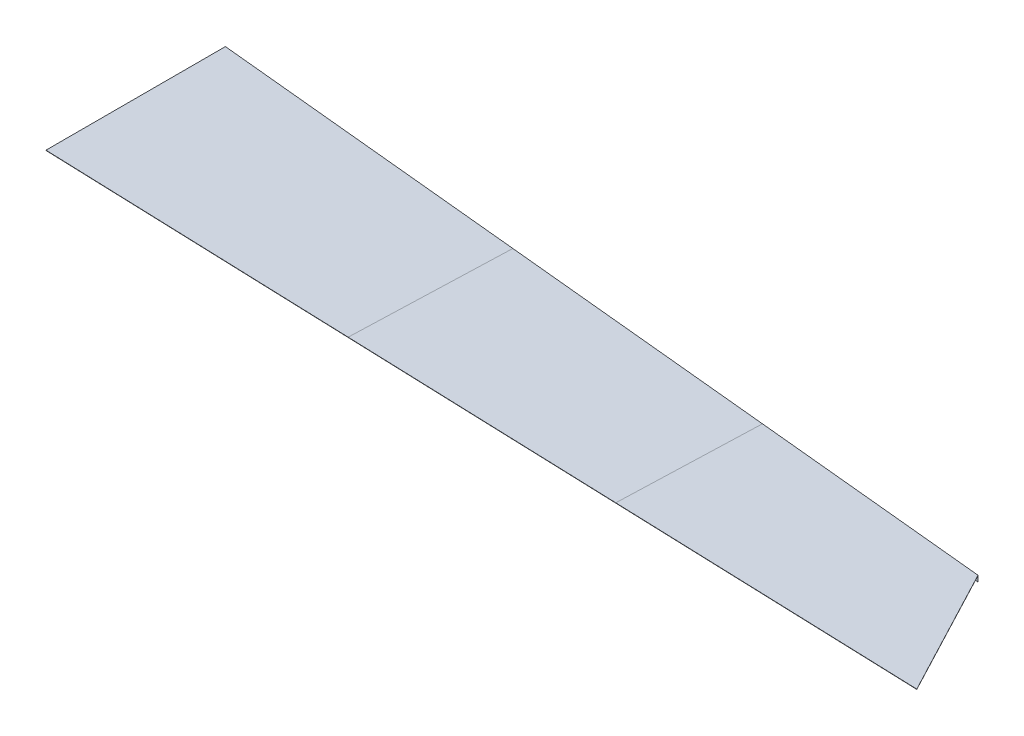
ISO-10303-21;
HEADER;
FILE_DESCRIPTION(('STEP AP214'),'2;1');
FILE_NAME('part.step','',(''),(''),'','','');
FILE_SCHEMA(('AUTOMOTIVE_DESIGN { 1 0 10303 214 1 1 1 1 }'));
ENDSEC;
DATA;
#1=APPLICATION_CONTEXT('core data for automotive mechanical design processes');
#2=APPLICATION_PROTOCOL_DEFINITION('international standard','automotive_design',2000,#1);
#3=PRODUCT_CONTEXT('',#1,'mechanical');
#4=PRODUCT('Part','Part','',(#3));
#5=PRODUCT_RELATED_PRODUCT_CATEGORY('part','',(#4));
#6=PRODUCT_DEFINITION_FORMATION('','',#4);
#7=PRODUCT_DEFINITION_CONTEXT('part definition',#1,'design');
#8=PRODUCT_DEFINITION('design','',#6,#7);
#9=PRODUCT_DEFINITION_SHAPE('','',#8);
#10=(LENGTH_UNIT() NAMED_UNIT(*) SI_UNIT(.MILLI.,.METRE.));
#11=(NAMED_UNIT(*) PLANE_ANGLE_UNIT() SI_UNIT($,.RADIAN.));
#12=(NAMED_UNIT(*) SI_UNIT($,.STERADIAN.) SOLID_ANGLE_UNIT());
#13=UNCERTAINTY_MEASURE_WITH_UNIT(LENGTH_MEASURE(1.E-05),#10,'distance_accuracy_value','');
#14=(GEOMETRIC_REPRESENTATION_CONTEXT(3) GLOBAL_UNCERTAINTY_ASSIGNED_CONTEXT((#13)) GLOBAL_UNIT_ASSIGNED_CONTEXT((#10,
#11,#12)) REPRESENTATION_CONTEXT('',''));
#15=CARTESIAN_POINT('',(0.,0.,0.));
#16=DIRECTION('',(0.,0.,1.));
#17=DIRECTION('',(1.,0.,0.));
#18=AXIS2_PLACEMENT_3D('',#15,#16,#17);
#19=CARTESIAN_POINT('',(-772.827090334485,-140.365470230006,-855.066311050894));
#20=DIRECTION('',(0.999396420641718,0.,0.0347389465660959));
#21=DIRECTION('',(0.0347389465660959,0.,-0.999396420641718));
#22=AXIS2_PLACEMENT_3D('',#19,#20,#21);
#23=PLANE('',#22);
#24=DIRECTION('',(0.,1.,0.));
#25=VECTOR('',#24,1.);
#26=CARTESIAN_POINT('',(-784.630637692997,-1.6256,-515.492888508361));
#27=LINE('',#26,#25);
#28=CARTESIAN_POINT('',(-784.630637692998,-1.6256,-515.492888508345));
#29=VERTEX_POINT('',#28);
#30=CARTESIAN_POINT('',(-784.630637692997,0.,-515.492888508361));
#31=VERTEX_POINT('',#30);
#32=EDGE_CURVE('E200',#29,#31,#27,.T.);
#33=ORIENTED_EDGE('',*,*,#32,.F.);
#34=DIRECTION('',(0.0347389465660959,0.,-0.999396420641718));
#35=VECTOR('',#34,1.);
#36=CARTESIAN_POINT('',(-801.58062102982,-1.6256,-27.8628838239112));
#37=LINE('',#36,#35);
#38=CARTESIAN_POINT('',(-753.442083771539,-1.6256,-1412.7489148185));
#39=VERTEX_POINT('',#38);
#40=EDGE_CURVE('E166',#29,#39,#37,.T.);
#41=ORIENTED_EDGE('',*,*,#40,.T.);
#42=DIRECTION('',(0.,-1.,0.));
#43=VECTOR('',#42,1.);
#44=CARTESIAN_POINT('',(-753.44208377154,0.,-1412.7489148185));
#45=LINE('',#44,#43);
#46=CARTESIAN_POINT('',(-753.442083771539,-31.75,-1412.7489148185));
#47=VERTEX_POINT('',#46);
#48=EDGE_CURVE('E151',#39,#47,#45,.T.);
#49=ORIENTED_EDGE('',*,*,#48,.T.);
#50=DIRECTION('',(0.0347389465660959,0.,-0.999396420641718));
#51=VECTOR('',#50,1.);
#52=CARTESIAN_POINT('',(-925.964378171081,-31.7499999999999,3550.50358841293));
#53=LINE('',#52,#51);
#54=CARTESIAN_POINT('',(-753.385500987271,-31.75,-1414.37673136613));
#55=VERTEX_POINT('',#54);
#56=EDGE_CURVE('E164',#47,#55,#53,.T.);
#57=ORIENTED_EDGE('',*,*,#56,.T.);
#58=DIRECTION('',(0.,-1.,0.));
#59=VECTOR('',#58,1.);
#60=CARTESIAN_POINT('',(-753.385500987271,0.,-1414.37673136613));
#61=LINE('',#60,#59);
#62=CARTESIAN_POINT('',(-753.385500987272,0.,-1414.37673136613));
#63=VERTEX_POINT('',#62);
#64=EDGE_CURVE('E182',#63,#55,#61,.T.);
#65=ORIENTED_EDGE('',*,*,#64,.F.);
#66=DIRECTION('',(0.0347389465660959,0.,-0.999396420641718));
#67=VECTOR('',#66,1.);
#68=CARTESIAN_POINT('',(-801.58062102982,0.,-27.8628838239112));
#69=LINE('',#68,#67);
#70=EDGE_CURVE('E197',#31,#63,#69,.T.);
#71=ORIENTED_EDGE('',*,*,#70,.F.);
#72=EDGE_LOOP('',(#33,#41,#49,#57,#65,#71));
#73=FACE_BOUND('',#72,.T.);
#74=ADVANCED_FACE('F93',(#73),#23,.T.);
#75=CARTESIAN_POINT('',(2571.71966629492,-1.62559999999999,-398.82639715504));
#76=DIRECTION('',(-0.0347389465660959,0.,0.999396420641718));
#77=DIRECTION('',(0.999396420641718,0.,0.0347389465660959));
#78=AXIS2_PLACEMENT_3D('',#75,#76,#77);
#79=PLANE('',#78);
#80=DIRECTION('',(0.999396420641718,0.,0.0347389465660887));
#81=VECTOR('',#80,1.);
#82=CARTESIAN_POINT('',(-2552.7,-1.62560000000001,-576.950850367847));
#83=LINE('',#82,#81);
#84=CARTESIAN_POINT('',(-2552.7,-1.62560000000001,-576.950850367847));
#85=VERTEX_POINT('',#84);
#86=EDGE_CURVE('E174',#85,#29,#83,.T.);
#87=ORIENTED_EDGE('',*,*,#86,.T.);
#88=ORIENTED_EDGE('',*,*,#32,.T.);
#89=DIRECTION('',(0.999396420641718,0.,0.0347389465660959));
#90=VECTOR('',#89,1.);
#91=CARTESIAN_POINT('',(2571.71966629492,0.,-398.82639715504));
#92=LINE('',#91,#90);
#93=CARTESIAN_POINT('',(-2552.7,0.,-576.950850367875));
#94=VERTEX_POINT('',#93);
#95=EDGE_CURVE('E179',#94,#31,#92,.T.);
#96=ORIENTED_EDGE('',*,*,#95,.F.);
#97=DIRECTION('',(0.,1.,0.));
#98=VECTOR('',#97,1.);
#99=CARTESIAN_POINT('',(-2552.7,-1.62559999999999,-576.950850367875));
#100=LINE('',#99,#98);
#101=EDGE_CURVE('E195',#85,#94,#100,.T.);
#102=ORIENTED_EDGE('',*,*,#101,.F.);
#103=EDGE_LOOP('',(#87,#88,#96,#102));
#104=FACE_BOUND('',#103,.T.);
#105=ADVANCED_FACE('F204',(#104),#79,.T.);
#106=CARTESIAN_POINT('',(0.,0.,0.));
#107=DIRECTION('',(0.,1.,0.));
#108=DIRECTION('',(-1.,0.,0.));
#109=AXIS2_PLACEMENT_3D('',#106,#107,#108);
#110=PLANE('',#109);
#111=ORIENTED_EDGE('',*,*,#95,.T.);
#112=ORIENTED_EDGE('',*,*,#70,.T.);
#113=DIRECTION('',(0.995256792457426,0.,0.0972826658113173));
#114=VECTOR('',#113,1.);
#115=CARTESIAN_POINT('',(2189.7343518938,0.,-1126.69766475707));
#116=LINE('',#115,#114);
#117=CARTESIAN_POINT('',(-2552.7,0.,-1590.25306039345));
#118=VERTEX_POINT('',#117);
#119=EDGE_CURVE('E157',#118,#63,#116,.T.);
#120=ORIENTED_EDGE('',*,*,#119,.F.);
#121=DIRECTION('',(0.,0.,-1.));
#122=VECTOR('',#121,1.);
#123=CARTESIAN_POINT('',(-2552.7,0.,1.09982839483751E-12));
#124=LINE('',#123,#122);
#125=EDGE_CURVE('E102',#94,#118,#124,.T.);
#126=ORIENTED_EDGE('',*,*,#125,.F.);
#127=EDGE_LOOP('',(#111,#112,#120,#126));
#128=FACE_BOUND('',#127,.T.);
#129=ADVANCED_FACE('F207',(#128),#110,.T.);
#130=CARTESIAN_POINT('',(0.,-1.6256,0.));
#131=DIRECTION('',(0.,1.,0.));
#132=DIRECTION('',(-1.,0.,0.));
#133=AXIS2_PLACEMENT_3D('',#130,#131,#132);
#134=PLANE('',#133);
#135=ORIENTED_EDGE('',*,*,#40,.F.);
#136=ORIENTED_EDGE('',*,*,#86,.F.);
#137=DIRECTION('',(0.,0.,-1.));
#138=VECTOR('',#137,1.);
#139=CARTESIAN_POINT('',(-2552.7,-1.62560000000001,1.09982839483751E-12));
#140=LINE('',#139,#138);
#141=CARTESIAN_POINT('',(-2552.7,-1.62560000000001,-1588.61971308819));
#142=VERTEX_POINT('',#141);
#143=EDGE_CURVE('E192',#85,#142,#140,.T.);
#144=ORIENTED_EDGE('',*,*,#143,.T.);
#145=DIRECTION('',(-0.995256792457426,0.,-0.0972826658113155));
#146=VECTOR('',#145,1.);
#147=CARTESIAN_POINT('',(-2578.1,-1.62560000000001,-1591.10246902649));
#148=LINE('',#147,#146);
#149=EDGE_CURVE('E177',#39,#142,#148,.T.);
#150=ORIENTED_EDGE('',*,*,#149,.F.);
#151=EDGE_LOOP('',(#135,#136,#144,#150));
#152=FACE_BOUND('',#151,.T.);
#153=ADVANCED_FACE('F211',(#152),#134,.F.);
#154=CARTESIAN_POINT('',(129.811722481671,0.,-1328.04747344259));
#155=DIRECTION('',(0.0972826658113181,0.,-0.995256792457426));
#156=DIRECTION('',(-0.995256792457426,0.,-0.0972826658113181));
#157=AXIS2_PLACEMENT_3D('',#154,#155,#156);
#158=PLANE('',#157);
#159=CARTESIAN_POINT('',(-768.259466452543,-19.05,-1415.83060640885));
#160=DIRECTION('',(0.0972826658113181,0.,-0.995256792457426));
#161=DIRECTION('',(-0.995256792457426,0.,-0.0972826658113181));
#162=AXIS2_PLACEMENT_3D('',#159,#160,#161);
#163=CIRCLE('',#162,1.58749999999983);
#164=CARTESIAN_POINT('',(-769.839436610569,-19.05,-1415.98504264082));
#165=VERTEX_POINT('',#164);
#166=EDGE_CURVE('E262',#165,#165,#163,.T.);
#167=ORIENTED_EDGE('',*,*,#166,.F.);
#168=EDGE_LOOP('',(#167));
#169=FACE_BOUND('',#168,.T.);
#170=CARTESIAN_POINT('',(-1122.1727818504,-19.05,-1450.42432237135));
#171=DIRECTION('',(0.0972826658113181,0.,-0.995256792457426));
#172=DIRECTION('',(-0.995256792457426,0.,-0.0972826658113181));
#173=AXIS2_PLACEMENT_3D('',#170,#171,#172);
#174=CIRCLE('',#173,1.58749999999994);
#175=CARTESIAN_POINT('',(-1123.75275200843,-19.05,-1450.57875860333));
#176=VERTEX_POINT('',#175);
#177=EDGE_CURVE('E284',#176,#176,#174,.T.);
#178=ORIENTED_EDGE('',*,*,#177,.F.);
#179=EDGE_LOOP('',(#178));
#180=FACE_BOUND('',#179,.T.);
#181=CARTESIAN_POINT('',(-1476.08609724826,-19.05,-1485.01803833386));
#182=DIRECTION('',(0.0972826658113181,0.,-0.995256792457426));
#183=DIRECTION('',(-0.995256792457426,0.,-0.0972826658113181));
#184=AXIS2_PLACEMENT_3D('',#181,#182,#183);
#185=CIRCLE('',#184,1.58749999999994);
#186=CARTESIAN_POINT('',(-1477.66606740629,-19.05,-1485.17247456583));
#187=VERTEX_POINT('',#186);
#188=EDGE_CURVE('E287',#187,#187,#185,.T.);
#189=ORIENTED_EDGE('',*,*,#188,.F.);
#190=EDGE_LOOP('',(#189));
#191=FACE_BOUND('',#190,.T.);
#192=CARTESIAN_POINT('',(-1829.99941264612,-19.05,-1519.61175429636));
#193=DIRECTION('',(0.0972826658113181,0.,-0.995256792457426));
#194=DIRECTION('',(-0.995256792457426,0.,-0.0972826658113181));
#195=AXIS2_PLACEMENT_3D('',#192,#193,#194);
#196=CIRCLE('',#195,1.58750000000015);
#197=CARTESIAN_POINT('',(-1831.57938280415,-19.05,-1519.76619052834));
#198=VERTEX_POINT('',#197);
#199=EDGE_CURVE('E292',#198,#198,#196,.T.);
#200=ORIENTED_EDGE('',*,*,#199,.F.);
#201=EDGE_LOOP('',(#200));
#202=FACE_BOUND('',#201,.T.);
#203=CARTESIAN_POINT('',(-2183.91272804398,-19.05,-1554.20547025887));
#204=DIRECTION('',(0.0972826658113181,0.,-0.995256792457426));
#205=DIRECTION('',(-0.995256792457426,0.,-0.0972826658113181));
#206=AXIS2_PLACEMENT_3D('',#203,#204,#205);
#207=CIRCLE('',#206,1.58750000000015);
#208=CARTESIAN_POINT('',(-2185.49269820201,-19.05,-1554.35990649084));
#209=VERTEX_POINT('',#208);
#210=EDGE_CURVE('E295',#209,#209,#207,.T.);
#211=ORIENTED_EDGE('',*,*,#210,.F.);
#212=EDGE_LOOP('',(#211));
#213=FACE_BOUND('',#212,.T.);
#214=CARTESIAN_POINT('',(-2537.82604344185,-19.05,-1588.79918622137));
#215=DIRECTION('',(0.0972826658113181,0.,-0.995256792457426));
#216=DIRECTION('',(-0.995256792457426,0.,-0.0972826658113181));
#217=AXIS2_PLACEMENT_3D('',#214,#215,#216);
#218=CIRCLE('',#217,1.58749999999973);
#219=CARTESIAN_POINT('',(-2539.40601359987,-19.05,-1588.95362245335));
#220=VERTEX_POINT('',#219);
#221=EDGE_CURVE('E298',#220,#220,#218,.T.);
#222=ORIENTED_EDGE('',*,*,#221,.F.);
#223=EDGE_LOOP('',(#222));
#224=FACE_BOUND('',#223,.T.);
#225=ORIENTED_EDGE('',*,*,#119,.T.);
#226=ORIENTED_EDGE('',*,*,#64,.T.);
#227=DIRECTION('',(0.995256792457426,0.,0.0972826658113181));
#228=VECTOR('',#227,1.);
#229=CARTESIAN_POINT('',(2189.7343518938,-31.75,-1126.69766475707));
#230=LINE('',#229,#228);
#231=CARTESIAN_POINT('',(-2552.7,-31.75,-1590.25306039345));
#232=VERTEX_POINT('',#231);
#233=EDGE_CURVE('E158',#232,#55,#230,.T.);
#234=ORIENTED_EDGE('',*,*,#233,.F.);
#235=DIRECTION('',(0.,-1.,0.));
#236=VECTOR('',#235,1.);
#237=CARTESIAN_POINT('',(-2552.7,0.,-1590.25306039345));
#238=LINE('',#237,#236);
#239=EDGE_CURVE('E13',#118,#232,#238,.T.);
#240=ORIENTED_EDGE('',*,*,#239,.F.);
#241=EDGE_LOOP('',(#225,#226,#234,#240));
#242=FACE_BOUND('',#241,.T.);
#243=ADVANCED_FACE('F208',(#169,#180,#191,#202,#213,#224,#242),#158,.T.);
#244=CARTESIAN_POINT('',(-2552.7,0.,1.09982839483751E-12));
#245=DIRECTION('',(1.,0.,0.));
#246=DIRECTION('',(0.,0.,-1.));
#247=AXIS2_PLACEMENT_3D('',#244,#245,#246);
#248=PLANE('',#247);
#249=ORIENTED_EDGE('',*,*,#101,.T.);
#250=ORIENTED_EDGE('',*,*,#125,.T.);
#251=ORIENTED_EDGE('',*,*,#239,.T.);
#252=DIRECTION('',(0.,0.,-1.));
#253=VECTOR('',#252,1.);
#254=CARTESIAN_POINT('',(-2552.7,-31.7499999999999,3642.60062259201));
#255=LINE('',#254,#253);
#256=CARTESIAN_POINT('',(-2552.7,-31.75,-1588.61971308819));
#257=VERTEX_POINT('',#256);
#258=EDGE_CURVE('E176',#257,#232,#255,.T.);
#259=ORIENTED_EDGE('',*,*,#258,.F.);
#260=DIRECTION('',(0.,-1.,0.));
#261=VECTOR('',#260,1.);
#262=CARTESIAN_POINT('',(-2552.7,0.,-1588.61971308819));
#263=LINE('',#262,#261);
#264=EDGE_CURVE('E153',#142,#257,#263,.T.);
#265=ORIENTED_EDGE('',*,*,#264,.F.);
#266=ORIENTED_EDGE('',*,*,#143,.F.);
#267=EDGE_LOOP('',(#249,#250,#251,#259,#265,#266));
#268=FACE_BOUND('',#267,.T.);
#269=ADVANCED_FACE('F210',(#268),#248,.F.);
#270=CARTESIAN_POINT('',(129.653579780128,0.,-1326.42958400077));
#271=DIRECTION('',(0.0972826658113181,0.,-0.995256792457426));
#272=DIRECTION('',(-0.995256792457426,0.,-0.0972826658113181));
#273=AXIS2_PLACEMENT_3D('',#270,#271,#272);
#274=PLANE('',#273);
#275=CARTESIAN_POINT('',(-768.417609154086,-19.05,-1414.21271696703));
#276=DIRECTION('',(0.0972826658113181,0.,-0.995256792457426));
#277=DIRECTION('',(-0.995256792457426,0.,-0.0972826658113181));
#278=AXIS2_PLACEMENT_3D('',#275,#276,#277);
#279=CIRCLE('',#278,1.58749999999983);
#280=CARTESIAN_POINT('',(-769.997579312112,-19.05,-1414.367153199));
#281=VERTEX_POINT('',#280);
#282=EDGE_CURVE('E97',#281,#281,#279,.T.);
#283=ORIENTED_EDGE('',*,*,#282,.T.);
#284=EDGE_LOOP('',(#283));
#285=FACE_BOUND('',#284,.T.);
#286=CARTESIAN_POINT('',(-1122.33092455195,-19.05,-1448.80643292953));
#287=DIRECTION('',(0.0972826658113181,0.,-0.995256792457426));
#288=DIRECTION('',(-0.995256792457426,0.,-0.0972826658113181));
#289=AXIS2_PLACEMENT_3D('',#286,#287,#288);
#290=CIRCLE('',#289,1.58749999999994);
#291=CARTESIAN_POINT('',(-1123.91089470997,-19.05,-1448.96086916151));
#292=VERTEX_POINT('',#291);
#293=EDGE_CURVE('E171',#292,#292,#290,.T.);
#294=ORIENTED_EDGE('',*,*,#293,.T.);
#295=EDGE_LOOP('',(#294));
#296=FACE_BOUND('',#295,.T.);
#297=CARTESIAN_POINT('',(-1476.24423994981,-19.05,-1483.40014889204));
#298=DIRECTION('',(0.0972826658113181,0.,-0.995256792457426));
#299=DIRECTION('',(-0.995256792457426,0.,-0.0972826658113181));
#300=AXIS2_PLACEMENT_3D('',#297,#298,#299);
#301=CIRCLE('',#300,1.58749999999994);
#302=CARTESIAN_POINT('',(-1477.82421010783,-19.05,-1483.55458512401));
#303=VERTEX_POINT('',#302);
#304=EDGE_CURVE('E272',#303,#303,#301,.T.);
#305=ORIENTED_EDGE('',*,*,#304,.T.);
#306=EDGE_LOOP('',(#305));
#307=FACE_BOUND('',#306,.T.);
#308=CARTESIAN_POINT('',(-1830.15755534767,-19.05,-1517.99386485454));
#309=DIRECTION('',(0.0972826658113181,0.,-0.995256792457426));
#310=DIRECTION('',(-0.995256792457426,0.,-0.0972826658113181));
#311=AXIS2_PLACEMENT_3D('',#308,#309,#310);
#312=CIRCLE('',#311,1.58750000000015);
#313=CARTESIAN_POINT('',(-1831.73752550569,-19.05,-1518.14830108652));
#314=VERTEX_POINT('',#313);
#315=EDGE_CURVE('E276',#314,#314,#312,.T.);
#316=ORIENTED_EDGE('',*,*,#315,.T.);
#317=EDGE_LOOP('',(#316));
#318=FACE_BOUND('',#317,.T.);
#319=CARTESIAN_POINT('',(-2184.07087074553,-19.05,-1552.58758081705));
#320=DIRECTION('',(0.0972826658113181,0.,-0.995256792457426));
#321=DIRECTION('',(-0.995256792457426,0.,-0.0972826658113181));
#322=AXIS2_PLACEMENT_3D('',#319,#320,#321);
#323=CIRCLE('',#322,1.58750000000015);
#324=CARTESIAN_POINT('',(-2185.65084090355,-19.05,-1552.74201704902));
#325=VERTEX_POINT('',#324);
#326=EDGE_CURVE('E280',#325,#325,#323,.T.);
#327=ORIENTED_EDGE('',*,*,#326,.T.);
#328=EDGE_LOOP('',(#327));
#329=FACE_BOUND('',#328,.T.);
#330=CARTESIAN_POINT('',(-2537.98418614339,-19.05,-1587.18129677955));
#331=DIRECTION('',(0.0972826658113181,0.,-0.995256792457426));
#332=DIRECTION('',(-0.995256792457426,0.,-0.0972826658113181));
#333=AXIS2_PLACEMENT_3D('',#330,#331,#332);
#334=CIRCLE('',#333,1.58749999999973);
#335=CARTESIAN_POINT('',(-2539.56415630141,-19.05,-1587.33573301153));
#336=VERTEX_POINT('',#335);
#337=EDGE_CURVE('E185',#336,#336,#334,.T.);
#338=ORIENTED_EDGE('',*,*,#337,.T.);
#339=EDGE_LOOP('',(#338));
#340=FACE_BOUND('',#339,.T.);
#341=ORIENTED_EDGE('',*,*,#48,.F.);
#342=ORIENTED_EDGE('',*,*,#149,.T.);
#343=ORIENTED_EDGE('',*,*,#264,.T.);
#344=DIRECTION('',(-0.995256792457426,0.,-0.0972826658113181));
#345=VECTOR('',#344,1.);
#346=CARTESIAN_POINT('',(2189.57620919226,-31.75,-1125.07977531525));
#347=LINE('',#346,#345);
#348=EDGE_CURVE('E148',#47,#257,#347,.T.);
#349=ORIENTED_EDGE('',*,*,#348,.F.);
#350=EDGE_LOOP('',(#341,#342,#343,#349));
#351=FACE_BOUND('',#350,.T.);
#352=ADVANCED_FACE('F150',(#285,#296,#307,#318,#329,#340,#351),#274,.F.);
#353=CARTESIAN_POINT('',(1723.55310604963,-31.7499999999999,3642.600622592));
#354=DIRECTION('',(0.,1.,0.));
#355=DIRECTION('',(0.,0.,1.));
#356=AXIS2_PLACEMENT_3D('',#353,#354,#355);
#357=PLANE('',#356);
#358=ORIENTED_EDGE('',*,*,#56,.F.);
#359=ORIENTED_EDGE('',*,*,#348,.T.);
#360=ORIENTED_EDGE('',*,*,#258,.T.);
#361=ORIENTED_EDGE('',*,*,#233,.T.);
#362=EDGE_LOOP('',(#358,#359,#360,#361));
#363=FACE_BOUND('',#362,.T.);
#364=ADVANCED_FACE('F95',(#363),#357,.F.);
#365=CARTESIAN_POINT('',(-2538.07314141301,-19.05,-1586.27123396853));
#366=DIRECTION('',(0.0972826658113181,0.,-0.995256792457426));
#367=DIRECTION('',(-0.995256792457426,0.,-0.0972826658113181));
#368=AXIS2_PLACEMENT_3D('',#365,#366,#367);
#369=CYLINDRICAL_SURFACE('',#368,1.58749999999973);
#370=ORIENTED_EDGE('',*,*,#221,.T.);
#371=EDGE_LOOP('',(#370));
#372=FACE_BOUND('',#371,.T.);
#373=ORIENTED_EDGE('',*,*,#337,.F.);
#374=EDGE_LOOP('',(#373));
#375=FACE_BOUND('',#374,.T.);
#376=ADVANCED_FACE('F234',(#372,#375),#369,.F.);
#377=CARTESIAN_POINT('',(-2184.15982601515,-19.05,-1551.67751800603));
#378=DIRECTION('',(0.0972826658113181,0.,-0.995256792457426));
#379=DIRECTION('',(-0.995256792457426,0.,-0.0972826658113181));
#380=AXIS2_PLACEMENT_3D('',#377,#378,#379);
#381=CYLINDRICAL_SURFACE('',#380,1.58750000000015);
#382=ORIENTED_EDGE('',*,*,#210,.T.);
#383=EDGE_LOOP('',(#382));
#384=FACE_BOUND('',#383,.T.);
#385=ORIENTED_EDGE('',*,*,#326,.F.);
#386=EDGE_LOOP('',(#385));
#387=FACE_BOUND('',#386,.T.);
#388=ADVANCED_FACE('F238',(#384,#387),#381,.F.);
#389=CARTESIAN_POINT('',(-1830.24651061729,-19.05,-1517.08380204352));
#390=DIRECTION('',(0.0972826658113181,0.,-0.995256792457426));
#391=DIRECTION('',(-0.995256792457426,0.,-0.0972826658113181));
#392=AXIS2_PLACEMENT_3D('',#389,#390,#391);
#393=CYLINDRICAL_SURFACE('',#392,1.58750000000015);
#394=ORIENTED_EDGE('',*,*,#199,.T.);
#395=EDGE_LOOP('',(#394));
#396=FACE_BOUND('',#395,.T.);
#397=ORIENTED_EDGE('',*,*,#315,.F.);
#398=EDGE_LOOP('',(#397));
#399=FACE_BOUND('',#398,.T.);
#400=ADVANCED_FACE('F242',(#396,#399),#393,.F.);
#401=CARTESIAN_POINT('',(-1476.33319521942,-19.05,-1482.49008608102));
#402=DIRECTION('',(0.0972826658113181,0.,-0.995256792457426));
#403=DIRECTION('',(-0.995256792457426,0.,-0.0972826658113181));
#404=AXIS2_PLACEMENT_3D('',#401,#402,#403);
#405=CYLINDRICAL_SURFACE('',#404,1.58749999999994);
#406=ORIENTED_EDGE('',*,*,#188,.T.);
#407=EDGE_LOOP('',(#406));
#408=FACE_BOUND('',#407,.T.);
#409=ORIENTED_EDGE('',*,*,#304,.F.);
#410=EDGE_LOOP('',(#409));
#411=FACE_BOUND('',#410,.T.);
#412=ADVANCED_FACE('F246',(#408,#411),#405,.F.);
#413=CARTESIAN_POINT('',(-1122.41987982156,-19.05,-1447.89637011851));
#414=DIRECTION('',(0.0972826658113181,0.,-0.995256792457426));
#415=DIRECTION('',(-0.995256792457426,0.,-0.0972826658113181));
#416=AXIS2_PLACEMENT_3D('',#413,#414,#415);
#417=CYLINDRICAL_SURFACE('',#416,1.58749999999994);
#418=ORIENTED_EDGE('',*,*,#177,.T.);
#419=EDGE_LOOP('',(#418));
#420=FACE_BOUND('',#419,.T.);
#421=ORIENTED_EDGE('',*,*,#293,.F.);
#422=EDGE_LOOP('',(#421));
#423=FACE_BOUND('',#422,.T.);
#424=ADVANCED_FACE('F250',(#420,#423),#417,.F.);
#425=CARTESIAN_POINT('',(-768.506564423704,-19.05,-1413.30265415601));
#426=DIRECTION('',(0.0972826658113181,0.,-0.995256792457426));
#427=DIRECTION('',(-0.995256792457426,0.,-0.0972826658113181));
#428=AXIS2_PLACEMENT_3D('',#425,#426,#427);
#429=CYLINDRICAL_SURFACE('',#428,1.58749999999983);
#430=ORIENTED_EDGE('',*,*,#166,.T.);
#431=EDGE_LOOP('',(#430));
#432=FACE_BOUND('',#431,.T.);
#433=ORIENTED_EDGE('',*,*,#282,.F.);
#434=EDGE_LOOP('',(#433));
#435=FACE_BOUND('',#434,.T.);
#436=ADVANCED_FACE('F254',(#432,#435),#429,.F.);
#437=CLOSED_SHELL('',(#74,#105,#129,#153,#243,#269,#352,#364,#376,#388,#400,#412,#424,#436));
#438=MANIFOLD_SOLID_BREP('B2',#437);
#439=CARTESIAN_POINT('',(791.646498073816,-124.144312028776,-759.116494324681));
#440=DIRECTION('',(0.999396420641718,0.,0.0347389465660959));
#441=DIRECTION('',(0.0347389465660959,0.,-0.999396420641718));
#442=AXIS2_PLACEMENT_3D('',#439,#440,#441);
#443=PLANE('',#442);
#444=DIRECTION('',(0.,1.,0.));
#445=VECTOR('',#444,1.);
#446=CARTESIAN_POINT('',(781.286136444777,-1.6256,-461.06173584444));
#447=LINE('',#446,#445);
#448=CARTESIAN_POINT('',(781.286136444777,-1.6256,-461.061735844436));
#449=VERTEX_POINT('',#448);
#450=CARTESIAN_POINT('',(781.286136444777,0.,-461.06173584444));
#451=VERTEX_POINT('',#450);
#452=EDGE_CURVE('E476',#449,#451,#447,.T.);
#453=ORIENTED_EDGE('',*,*,#452,.T.);
#454=DIRECTION('',(0.0347389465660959,0.,-0.999396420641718));
#455=VECTOR('',#454,1.);
#456=CARTESIAN_POINT('',(764.336153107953,0.,26.5682688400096));
#457=LINE('',#456,#455);
#458=CARTESIAN_POINT('',(809.114461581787,0.,-1261.64814630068));
#459=VERTEX_POINT('',#458);
#460=EDGE_CURVE('E472',#451,#459,#457,.T.);
#461=ORIENTED_EDGE('',*,*,#460,.T.);
#462=DIRECTION('',(0.,-1.,0.));
#463=VECTOR('',#462,1.);
#464=CARTESIAN_POINT('',(809.114461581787,0.,-1261.64814630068));
#465=LINE('',#464,#463);
#466=CARTESIAN_POINT('',(809.114461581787,-31.75,-1261.64814630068));
#467=VERTEX_POINT('',#466);
#468=EDGE_CURVE('E466',#459,#467,#465,.T.);
#469=ORIENTED_EDGE('',*,*,#468,.T.);
#470=DIRECTION('',(0.0347389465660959,0.,-0.999396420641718));
#471=VECTOR('',#470,1.);
#472=CARTESIAN_POINT('',(639.952395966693,-31.7499999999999,3604.93474107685));
#473=LINE('',#472,#471);
#474=CARTESIAN_POINT('',(809.057878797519,-31.75,-1260.02032975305));
#475=VERTEX_POINT('',#474);
#476=EDGE_CURVE('E494',#475,#467,#473,.T.);
#477=ORIENTED_EDGE('',*,*,#476,.F.);
#478=DIRECTION('',(0.,-1.,0.));
#479=VECTOR('',#478,1.);
#480=CARTESIAN_POINT('',(809.057878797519,0.,-1260.02032975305));
#481=LINE('',#480,#479);
#482=CARTESIAN_POINT('',(809.057878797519,-1.6256,-1260.02032975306));
#483=VERTEX_POINT('',#482);
#484=EDGE_CURVE('E569',#483,#475,#481,.T.);
#485=ORIENTED_EDGE('',*,*,#484,.F.);
#486=DIRECTION('',(0.0347389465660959,0.,-0.999396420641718));
#487=VECTOR('',#486,1.);
#488=CARTESIAN_POINT('',(764.336153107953,-1.6256,26.5682688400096));
#489=LINE('',#488,#487);
#490=EDGE_CURVE('E571',#449,#483,#489,.T.);
#491=ORIENTED_EDGE('',*,*,#490,.F.);
#492=EDGE_LOOP('',(#453,#461,#469,#477,#485,#491));
#493=FACE_BOUND('',#492,.T.);
#494=ADVANCED_FACE('F411',(#493),#443,.F.);
#495=CARTESIAN_POINT('',(2155.9544129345,0.,-1134.43034826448));
#496=DIRECTION('',(-0.884966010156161,0.,0.465655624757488));
#497=DIRECTION('',(0.465655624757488,0.,0.884966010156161));
#498=AXIS2_PLACEMENT_3D('',#495,#496,#497);
#499=PLANE('',#498);
#500=DIRECTION('',(0.,-1.,0.));
#501=VECTOR('',#500,1.);
#502=CARTESIAN_POINT('',(2542.48326093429,-1.62559999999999,-399.842652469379));
#503=LINE('',#502,#501);
#504=CARTESIAN_POINT('',(2542.48326093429,0.,-399.842652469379));
#505=VERTEX_POINT('',#504);
#506=CARTESIAN_POINT('',(2542.48326093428,-1.62559999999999,-399.842652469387));
#507=VERTEX_POINT('',#506);
#508=EDGE_CURVE('E584',#505,#507,#503,.T.);
#509=ORIENTED_EDGE('',*,*,#508,.T.);
#510=DIRECTION('',(0.465655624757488,0.,0.884966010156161));
#511=VECTOR('',#510,1.);
#512=CARTESIAN_POINT('',(2155.9544129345,-1.62559999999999,-1134.43034826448));
#513=LINE('',#512,#511);
#514=CARTESIAN_POINT('',(2159.3182985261,-1.62559999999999,-1128.03737403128));
#515=VERTEX_POINT('',#514);
#516=EDGE_CURVE('E583',#515,#507,#513,.T.);
#517=ORIENTED_EDGE('',*,*,#516,.F.);
#518=DIRECTION('',(0.,1.,0.));
#519=VECTOR('',#518,1.);
#520=CARTESIAN_POINT('',(2159.3182985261,0.,-1128.03737403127));
#521=LINE('',#520,#519);
#522=CARTESIAN_POINT('',(2159.3182985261,-31.75,-1128.03737403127));
#523=VERTEX_POINT('',#522);
#524=EDGE_CURVE('E566',#523,#515,#521,.T.);
#525=ORIENTED_EDGE('',*,*,#524,.F.);
#526=DIRECTION('',(0.465655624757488,0.,0.884966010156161));
#527=VECTOR('',#526,1.);
#528=CARTESIAN_POINT('',(4030.75843422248,-31.75,2428.5843482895));
#529=LINE('',#528,#527);
#530=CARTESIAN_POINT('',(2158.41225593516,-31.75,-1129.75928364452));
#531=VERTEX_POINT('',#530);
#532=EDGE_CURVE('E562',#531,#523,#529,.T.);
#533=ORIENTED_EDGE('',*,*,#532,.F.);
#534=DIRECTION('',(0.,1.,0.));
#535=VECTOR('',#534,1.);
#536=CARTESIAN_POINT('',(2158.41225593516,0.,-1129.75928364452));
#537=LINE('',#536,#535);
#538=CARTESIAN_POINT('',(2158.41225593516,0.,-1129.75928364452));
#539=VERTEX_POINT('',#538);
#540=EDGE_CURVE('E91',#531,#539,#537,.T.);
#541=ORIENTED_EDGE('',*,*,#540,.T.);
#542=DIRECTION('',(0.465655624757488,0.,0.884966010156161));
#543=VECTOR('',#542,1.);
#544=CARTESIAN_POINT('',(2155.9544129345,0.,-1134.43034826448));
#545=LINE('',#544,#543);
#546=EDGE_CURVE('E420',#539,#505,#545,.T.);
#547=ORIENTED_EDGE('',*,*,#546,.T.);
#548=EDGE_LOOP('',(#509,#517,#525,#533,#541,#547));
#549=FACE_BOUND('',#548,.T.);
#550=ADVANCED_FACE('F526',(#549),#499,.F.);
#551=CARTESIAN_POINT('',(2571.71966629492,-1.62559999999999,-398.82639715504));
#552=DIRECTION('',(-0.0347389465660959,0.,0.999396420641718));
#553=DIRECTION('',(0.999396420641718,0.,0.0347389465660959));
#554=AXIS2_PLACEMENT_3D('',#551,#552,#553);
#555=PLANE('',#554);
#556=ORIENTED_EDGE('',*,*,#452,.F.);
#557=DIRECTION('',(0.999396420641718,0.,0.0347389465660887));
#558=VECTOR('',#557,1.);
#559=CARTESIAN_POINT('',(-2552.7,-1.62560000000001,-576.950850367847));
#560=LINE('',#559,#558);
#561=EDGE_CURVE('E579',#449,#507,#560,.T.);
#562=ORIENTED_EDGE('',*,*,#561,.T.);
#563=ORIENTED_EDGE('',*,*,#508,.F.);
#564=DIRECTION('',(0.999396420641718,0.,0.0347389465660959));
#565=VECTOR('',#564,1.);
#566=CARTESIAN_POINT('',(2571.71966629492,0.,-398.82639715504));
#567=LINE('',#566,#565);
#568=EDGE_CURVE('E435',#451,#505,#567,.T.);
#569=ORIENTED_EDGE('',*,*,#568,.F.);
#570=EDGE_LOOP('',(#556,#562,#563,#569));
#571=FACE_BOUND('',#570,.T.);
#572=ADVANCED_FACE('F528',(#571),#555,.T.);
#573=CARTESIAN_POINT('',(0.,-1.6256,0.));
#574=DIRECTION('',(0.,1.,0.));
#575=DIRECTION('',(-1.,0.,0.));
#576=AXIS2_PLACEMENT_3D('',#573,#574,#575);
#577=PLANE('',#576);
#578=ORIENTED_EDGE('',*,*,#561,.F.);
#579=ORIENTED_EDGE('',*,*,#490,.T.);
#580=DIRECTION('',(-0.995256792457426,0.,-0.0972826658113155));
#581=VECTOR('',#580,1.);
#582=CARTESIAN_POINT('',(-2578.1,-1.62560000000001,-1591.10246902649));
#583=LINE('',#582,#581);
#584=EDGE_CURVE('E481',#515,#483,#583,.T.);
#585=ORIENTED_EDGE('',*,*,#584,.F.);
#586=ORIENTED_EDGE('',*,*,#516,.T.);
#587=EDGE_LOOP('',(#578,#579,#585,#586));
#588=FACE_BOUND('',#587,.T.);
#589=ADVANCED_FACE('F537',(#588),#577,.F.);
#590=CARTESIAN_POINT('',(0.,0.,0.));
#591=DIRECTION('',(0.,1.,0.));
#592=DIRECTION('',(-1.,0.,0.));
#593=AXIS2_PLACEMENT_3D('',#590,#591,#592);
#594=PLANE('',#593);
#595=ORIENTED_EDGE('',*,*,#460,.F.);
#596=ORIENTED_EDGE('',*,*,#568,.T.);
#597=ORIENTED_EDGE('',*,*,#546,.F.);
#598=DIRECTION('',(0.995256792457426,0.,0.0972826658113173));
#599=VECTOR('',#598,1.);
#600=CARTESIAN_POINT('',(2189.7343518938,0.,-1126.69766475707));
#601=LINE('',#600,#599);
#602=EDGE_CURVE('E428',#459,#539,#601,.T.);
#603=ORIENTED_EDGE('',*,*,#602,.F.);
#604=EDGE_LOOP('',(#595,#596,#597,#603));
#605=FACE_BOUND('',#604,.T.);
#606=ADVANCED_FACE('F478',(#605),#594,.T.);
#607=CARTESIAN_POINT('',(129.811722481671,0.,-1328.04747344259));
#608=DIRECTION('',(0.0972826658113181,0.,-0.995256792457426));
#609=DIRECTION('',(-0.995256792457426,0.,-0.0972826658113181));
#610=AXIS2_PLACEMENT_3D('',#607,#608,#609);
#611=PLANE('',#610);
#612=CARTESIAN_POINT('',(2141.03258419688,-19.0500000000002,-1131.45808219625));
#613=DIRECTION('',(0.0972826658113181,0.,-0.995256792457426));
#614=DIRECTION('',(-0.995256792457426,0.,-0.0972826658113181));
#615=AXIS2_PLACEMENT_3D('',#612,#613,#614);
#616=CIRCLE('',#615,1.58750000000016);
#617=CARTESIAN_POINT('',(2139.45261403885,-19.0500000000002,-1131.61251842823));
#618=VERTEX_POINT('',#617);
#619=EDGE_CURVE('E499',#618,#618,#616,.T.);
#620=ORIENTED_EDGE('',*,*,#619,.F.);
#621=EDGE_LOOP('',(#620));
#622=FACE_BOUND('',#621,.T.);
#623=CARTESIAN_POINT('',(1812.39879132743,-19.0499999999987,-1163.58081844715));
#624=DIRECTION('',(0.0972826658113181,0.,-0.995256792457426));
#625=DIRECTION('',(-0.995256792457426,0.,-0.0972826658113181));
#626=AXIS2_PLACEMENT_3D('',#623,#624,#625);
#627=CIRCLE('',#626,1.58749999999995);
#628=CARTESIAN_POINT('',(1810.81882116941,-19.0499999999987,-1163.73525467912));
#629=VERTEX_POINT('',#628);
#630=EDGE_CURVE('E612',#629,#629,#627,.T.);
#631=ORIENTED_EDGE('',*,*,#630,.F.);
#632=EDGE_LOOP('',(#631));
#633=FACE_BOUND('',#632,.T.);
#634=CARTESIAN_POINT('',(1483.76499845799,-19.0499999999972,-1195.70355469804));
#635=DIRECTION('',(0.0972826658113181,0.,-0.995256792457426));
#636=DIRECTION('',(-0.995256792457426,0.,-0.0972826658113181));
#637=AXIS2_PLACEMENT_3D('',#634,#635,#636);
#638=CIRCLE('',#637,1.58749999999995);
#639=CARTESIAN_POINT('',(1482.18502829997,-19.0499999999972,-1195.85799093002));
#640=VERTEX_POINT('',#639);
#641=EDGE_CURVE('E603',#640,#640,#638,.T.);
#642=ORIENTED_EDGE('',*,*,#641,.F.);
#643=EDGE_LOOP('',(#642));
#644=FACE_BOUND('',#643,.T.);
#645=CARTESIAN_POINT('',(1155.13120558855,-19.0499999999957,-1227.82629094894));
#646=DIRECTION('',(0.0972826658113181,0.,-0.995256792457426));
#647=DIRECTION('',(-0.995256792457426,0.,-0.0972826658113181));
#648=AXIS2_PLACEMENT_3D('',#645,#646,#647);
#649=CIRCLE('',#648,1.58750000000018);
#650=CARTESIAN_POINT('',(1153.55123543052,-19.0499999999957,-1227.98072718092));
#651=VERTEX_POINT('',#650);
#652=EDGE_CURVE('E613',#651,#651,#649,.T.);
#653=ORIENTED_EDGE('',*,*,#652,.F.);
#654=EDGE_LOOP('',(#653));
#655=FACE_BOUND('',#654,.T.);
#656=CARTESIAN_POINT('',(826.497412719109,-19.0499999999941,-1259.94902719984));
#657=DIRECTION('',(0.0972826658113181,0.,-0.995256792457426));
#658=DIRECTION('',(-0.995256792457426,0.,-0.0972826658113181));
#659=AXIS2_PLACEMENT_3D('',#656,#657,#658);
#660=CIRCLE('',#659,1.58749999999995);
#661=CARTESIAN_POINT('',(824.917442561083,-19.0499999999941,-1260.10346343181));
#662=VERTEX_POINT('',#661);
#663=EDGE_CURVE('E487',#662,#662,#660,.T.);
#664=ORIENTED_EDGE('',*,*,#663,.F.);
#665=EDGE_LOOP('',(#664));
#666=FACE_BOUND('',#665,.T.);
#667=ORIENTED_EDGE('',*,*,#468,.F.);
#668=ORIENTED_EDGE('',*,*,#602,.T.);
#669=ORIENTED_EDGE('',*,*,#540,.F.);
#670=DIRECTION('',(0.995256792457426,0.,0.0972826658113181));
#671=VECTOR('',#670,1.);
#672=CARTESIAN_POINT('',(2189.7343518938,-31.75,-1126.69766475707));
#673=LINE('',#672,#671);
#674=EDGE_CURVE('E469',#467,#531,#673,.T.);
#675=ORIENTED_EDGE('',*,*,#674,.F.);
#676=EDGE_LOOP('',(#667,#668,#669,#675));
#677=FACE_BOUND('',#676,.T.);
#678=ADVANCED_FACE('F468',(#622,#633,#644,#655,#666,#677),#611,.T.);
#679=CARTESIAN_POINT('',(129.653579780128,0.,-1326.42958400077));
#680=DIRECTION('',(0.0972826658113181,0.,-0.995256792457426));
#681=DIRECTION('',(-0.995256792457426,0.,-0.0972826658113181));
#682=AXIS2_PLACEMENT_3D('',#679,#680,#681);
#683=PLANE('',#682);
#684=CARTESIAN_POINT('',(2140.87444149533,-19.0500000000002,-1129.84019275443));
#685=DIRECTION('',(0.0972826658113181,0.,-0.995256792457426));
#686=DIRECTION('',(-0.995256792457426,0.,-0.0972826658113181));
#687=AXIS2_PLACEMENT_3D('',#684,#685,#686);
#688=CIRCLE('',#687,1.58750000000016);
#689=CARTESIAN_POINT('',(2139.29447133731,-19.0500000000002,-1129.99462898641));
#690=VERTEX_POINT('',#689);
#691=EDGE_CURVE('E415',#690,#690,#688,.T.);
#692=ORIENTED_EDGE('',*,*,#691,.T.);
#693=EDGE_LOOP('',(#692));
#694=FACE_BOUND('',#693,.T.);
#695=CARTESIAN_POINT('',(1812.24064862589,-19.0499999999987,-1161.96292900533));
#696=DIRECTION('',(0.0972826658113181,0.,-0.995256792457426));
#697=DIRECTION('',(-0.995256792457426,0.,-0.0972826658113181));
#698=AXIS2_PLACEMENT_3D('',#695,#696,#697);
#699=CIRCLE('',#698,1.58749999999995);
#700=CARTESIAN_POINT('',(1810.66067846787,-19.0499999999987,-1162.1173652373));
#701=VERTEX_POINT('',#700);
#702=EDGE_CURVE('E504',#701,#701,#699,.T.);
#703=ORIENTED_EDGE('',*,*,#702,.T.);
#704=EDGE_LOOP('',(#703));
#705=FACE_BOUND('',#704,.T.);
#706=CARTESIAN_POINT('',(1483.60685575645,-19.0499999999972,-1194.08566525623));
#707=DIRECTION('',(0.0972826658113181,0.,-0.995256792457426));
#708=DIRECTION('',(-0.995256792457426,0.,-0.0972826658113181));
#709=AXIS2_PLACEMENT_3D('',#706,#707,#708);
#710=CIRCLE('',#709,1.58749999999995);
#711=CARTESIAN_POINT('',(1482.02688559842,-19.0499999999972,-1194.2401014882));
#712=VERTEX_POINT('',#711);
#713=EDGE_CURVE('E502',#712,#712,#710,.T.);
#714=ORIENTED_EDGE('',*,*,#713,.T.);
#715=EDGE_LOOP('',(#714));
#716=FACE_BOUND('',#715,.T.);
#717=CARTESIAN_POINT('',(1154.97306288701,-19.0499999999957,-1226.20840150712));
#718=DIRECTION('',(0.0972826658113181,0.,-0.995256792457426));
#719=DIRECTION('',(-0.995256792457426,0.,-0.0972826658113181));
#720=AXIS2_PLACEMENT_3D('',#717,#718,#719);
#721=CIRCLE('',#720,1.58750000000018);
#722=CARTESIAN_POINT('',(1153.39309272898,-19.0499999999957,-1226.3628377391));
#723=VERTEX_POINT('',#722);
#724=EDGE_CURVE('E498',#723,#723,#721,.T.);
#725=ORIENTED_EDGE('',*,*,#724,.T.);
#726=EDGE_LOOP('',(#725));
#727=FACE_BOUND('',#726,.T.);
#728=CARTESIAN_POINT('',(826.339270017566,-19.0499999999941,-1258.33113775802));
#729=DIRECTION('',(0.0972826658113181,0.,-0.995256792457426));
#730=DIRECTION('',(-0.995256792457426,0.,-0.0972826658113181));
#731=AXIS2_PLACEMENT_3D('',#728,#729,#730);
#732=CIRCLE('',#731,1.58749999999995);
#733=CARTESIAN_POINT('',(824.75929985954,-19.0499999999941,-1258.48557399));
#734=VERTEX_POINT('',#733);
#735=EDGE_CURVE('E495',#734,#734,#732,.T.);
#736=ORIENTED_EDGE('',*,*,#735,.T.);
#737=EDGE_LOOP('',(#736));
#738=FACE_BOUND('',#737,.T.);
#739=ORIENTED_EDGE('',*,*,#584,.T.);
#740=ORIENTED_EDGE('',*,*,#484,.T.);
#741=DIRECTION('',(-0.995256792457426,0.,-0.0972826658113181));
#742=VECTOR('',#741,1.);
#743=CARTESIAN_POINT('',(2189.57620919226,-31.75,-1125.07977531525));
#744=LINE('',#743,#742);
#745=EDGE_CURVE('E479',#523,#475,#744,.T.);
#746=ORIENTED_EDGE('',*,*,#745,.F.);
#747=ORIENTED_EDGE('',*,*,#524,.T.);
#748=EDGE_LOOP('',(#739,#740,#746,#747));
#749=FACE_BOUND('',#748,.T.);
#750=ADVANCED_FACE('F511',(#694,#705,#716,#727,#738,#749),#683,.F.);
#751=CARTESIAN_POINT('',(1723.55310604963,-31.7499999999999,3642.600622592));
#752=DIRECTION('',(0.,1.,0.));
#753=DIRECTION('',(0.,0.,1.));
#754=AXIS2_PLACEMENT_3D('',#751,#752,#753);
#755=PLANE('',#754);
#756=ORIENTED_EDGE('',*,*,#745,.T.);
#757=ORIENTED_EDGE('',*,*,#476,.T.);
#758=ORIENTED_EDGE('',*,*,#674,.T.);
#759=ORIENTED_EDGE('',*,*,#532,.T.);
#760=EDGE_LOOP('',(#756,#757,#758,#759));
#761=FACE_BOUND('',#760,.T.);
#762=ADVANCED_FACE('F413',(#761),#755,.F.);
#763=CARTESIAN_POINT('',(826.250314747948,-19.0499999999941,-1257.421074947));
#764=DIRECTION('',(0.0972826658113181,0.,-0.995256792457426));
#765=DIRECTION('',(-0.995256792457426,0.,-0.0972826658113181));
#766=AXIS2_PLACEMENT_3D('',#763,#764,#765);
#767=CYLINDRICAL_SURFACE('',#766,1.58749999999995);
#768=ORIENTED_EDGE('',*,*,#663,.T.);
#769=EDGE_LOOP('',(#768));
#770=FACE_BOUND('',#769,.T.);
#771=ORIENTED_EDGE('',*,*,#735,.F.);
#772=EDGE_LOOP('',(#771));
#773=FACE_BOUND('',#772,.T.);
#774=ADVANCED_FACE('F534',(#770,#773),#767,.F.);
#775=CARTESIAN_POINT('',(1154.88410761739,-19.0499999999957,-1225.2983386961));
#776=DIRECTION('',(0.0972826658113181,0.,-0.995256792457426));
#777=DIRECTION('',(-0.995256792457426,0.,-0.0972826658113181));
#778=AXIS2_PLACEMENT_3D('',#775,#776,#777);
#779=CYLINDRICAL_SURFACE('',#778,1.58750000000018);
#780=ORIENTED_EDGE('',*,*,#652,.T.);
#781=EDGE_LOOP('',(#780));
#782=FACE_BOUND('',#781,.T.);
#783=ORIENTED_EDGE('',*,*,#724,.F.);
#784=EDGE_LOOP('',(#783));
#785=FACE_BOUND('',#784,.T.);
#786=ADVANCED_FACE('F557',(#782,#785),#779,.F.);
#787=CARTESIAN_POINT('',(1483.51790048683,-19.0499999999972,-1193.1756024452));
#788=DIRECTION('',(0.0972826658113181,0.,-0.995256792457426));
#789=DIRECTION('',(-0.995256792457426,0.,-0.0972826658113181));
#790=AXIS2_PLACEMENT_3D('',#787,#788,#789);
#791=CYLINDRICAL_SURFACE('',#790,1.58749999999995);
#792=ORIENTED_EDGE('',*,*,#641,.T.);
#793=EDGE_LOOP('',(#792));
#794=FACE_BOUND('',#793,.T.);
#795=ORIENTED_EDGE('',*,*,#713,.F.);
#796=EDGE_LOOP('',(#795));
#797=FACE_BOUND('',#796,.T.);
#798=ADVANCED_FACE('F521',(#794,#797),#791,.F.);
#799=CARTESIAN_POINT('',(1812.15169335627,-19.0499999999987,-1161.05286619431));
#800=DIRECTION('',(0.0972826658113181,0.,-0.995256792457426));
#801=DIRECTION('',(-0.995256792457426,0.,-0.0972826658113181));
#802=AXIS2_PLACEMENT_3D('',#799,#800,#801);
#803=CYLINDRICAL_SURFACE('',#802,1.58749999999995);
#804=ORIENTED_EDGE('',*,*,#630,.T.);
#805=EDGE_LOOP('',(#804));
#806=FACE_BOUND('',#805,.T.);
#807=ORIENTED_EDGE('',*,*,#702,.F.);
#808=EDGE_LOOP('',(#807));
#809=FACE_BOUND('',#808,.T.);
#810=ADVANCED_FACE('F515',(#806,#809),#803,.F.);
#811=CARTESIAN_POINT('',(2140.78548622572,-19.0500000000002,-1128.93012994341));
#812=DIRECTION('',(0.0972826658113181,0.,-0.995256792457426));
#813=DIRECTION('',(-0.995256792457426,0.,-0.0972826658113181));
#814=AXIS2_PLACEMENT_3D('',#811,#812,#813);
#815=CYLINDRICAL_SURFACE('',#814,1.58750000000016);
#816=ORIENTED_EDGE('',*,*,#619,.T.);
#817=EDGE_LOOP('',(#816));
#818=FACE_BOUND('',#817,.T.);
#819=ORIENTED_EDGE('',*,*,#691,.F.);
#820=EDGE_LOOP('',(#819));
#821=FACE_BOUND('',#820,.T.);
#822=ADVANCED_FACE('F513',(#818,#821),#815,.F.);
#823=CLOSED_SHELL('',(#494,#550,#572,#589,#606,#678,#750,#762,#774,#786,#798,#810,#822));
#824=MANIFOLD_SOLID_BREP('B7',#823);
#825=CARTESIAN_POINT('',(-772.827090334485,-140.365470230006,-855.066311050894));
#826=DIRECTION('',(0.999396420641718,0.,0.0347389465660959));
#827=DIRECTION('',(0.0347389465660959,0.,-0.999396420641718));
#828=AXIS2_PLACEMENT_3D('',#825,#826,#827);
#829=PLANE('',#828);
#830=DIRECTION('',(0.,1.,0.));
#831=VECTOR('',#830,1.);
#832=CARTESIAN_POINT('',(-784.630637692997,-1.6256,-515.492888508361));
#833=LINE('',#832,#831);
#834=CARTESIAN_POINT('',(-784.630637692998,-1.6256,-515.492888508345));
#835=VERTEX_POINT('',#834);
#836=CARTESIAN_POINT('',(-784.630637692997,0.,-515.492888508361));
#837=VERTEX_POINT('',#836);
#838=EDGE_CURVE('E788',#835,#837,#833,.T.);
#839=ORIENTED_EDGE('',*,*,#838,.T.);
#840=DIRECTION('',(0.0347389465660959,0.,-0.999396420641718));
#841=VECTOR('',#840,1.);
#842=CARTESIAN_POINT('',(-801.58062102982,0.,-27.8628838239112));
#843=LINE('',#842,#841);
#844=CARTESIAN_POINT('',(-753.385500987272,0.,-1414.37673136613));
#845=VERTEX_POINT('',#844);
#846=EDGE_CURVE('E781',#837,#845,#843,.T.);
#847=ORIENTED_EDGE('',*,*,#846,.T.);
#848=DIRECTION('',(0.,-1.,0.));
#849=VECTOR('',#848,1.);
#850=CARTESIAN_POINT('',(-753.385500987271,0.,-1414.37673136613));
#851=LINE('',#850,#849);
#852=CARTESIAN_POINT('',(-753.385500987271,-31.75,-1414.37673136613));
#853=VERTEX_POINT('',#852);
#854=EDGE_CURVE('E765',#845,#853,#851,.T.);
#855=ORIENTED_EDGE('',*,*,#854,.T.);
#856=DIRECTION('',(0.0347389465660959,0.,-0.999396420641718));
#857=VECTOR('',#856,1.);
#858=CARTESIAN_POINT('',(-925.964378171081,-31.7499999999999,3550.50358841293));
#859=LINE('',#858,#857);
#860=CARTESIAN_POINT('',(-753.442083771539,-31.75,-1412.7489148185));
#861=VERTEX_POINT('',#860);
#862=EDGE_CURVE('E760',#861,#853,#859,.T.);
#863=ORIENTED_EDGE('',*,*,#862,.F.);
#864=DIRECTION('',(0.,-1.,0.));
#865=VECTOR('',#864,1.);
#866=CARTESIAN_POINT('',(-753.44208377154,0.,-1412.7489148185));
#867=LINE('',#866,#865);
#868=CARTESIAN_POINT('',(-753.442083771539,-1.6256,-1412.7489148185));
#869=VERTEX_POINT('',#868);
#870=EDGE_CURVE('E754',#869,#861,#867,.T.);
#871=ORIENTED_EDGE('',*,*,#870,.F.);
#872=DIRECTION('',(0.0347389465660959,0.,-0.999396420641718));
#873=VECTOR('',#872,1.);
#874=CARTESIAN_POINT('',(-801.58062102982,-1.6256,-27.8628838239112));
#875=LINE('',#874,#873);
#876=EDGE_CURVE('E784',#835,#869,#875,.T.);
#877=ORIENTED_EDGE('',*,*,#876,.F.);
#878=EDGE_LOOP('',(#839,#847,#855,#863,#871,#877));
#879=FACE_BOUND('',#878,.T.);
#880=ADVANCED_FACE('F699',(#879),#829,.F.);
#881=CARTESIAN_POINT('',(791.646498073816,-124.144312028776,-759.116494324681));
#882=DIRECTION('',(0.999396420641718,0.,0.0347389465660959));
#883=DIRECTION('',(0.0347389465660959,0.,-0.999396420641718));
#884=AXIS2_PLACEMENT_3D('',#881,#882,#883);
#885=PLANE('',#884);
#886=DIRECTION('',(0.,1.,0.));
#887=VECTOR('',#886,1.);
#888=CARTESIAN_POINT('',(781.286136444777,-1.6256,-461.06173584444));
#889=LINE('',#888,#887);
#890=CARTESIAN_POINT('',(781.286136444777,-1.6256,-461.061735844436));
#891=VERTEX_POINT('',#890);
#892=CARTESIAN_POINT('',(781.286136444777,0.,-461.06173584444));
#893=VERTEX_POINT('',#892);
#894=EDGE_CURVE('E786',#891,#893,#889,.T.);
#895=ORIENTED_EDGE('',*,*,#894,.F.);
#896=DIRECTION('',(0.0347389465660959,0.,-0.999396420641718));
#897=VECTOR('',#896,1.);
#898=CARTESIAN_POINT('',(764.336153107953,-1.6256,26.5682688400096));
#899=LINE('',#898,#897);
#900=CARTESIAN_POINT('',(809.057878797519,-1.6256,-1260.02032975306));
#901=VERTEX_POINT('',#900);
#902=EDGE_CURVE('E783',#891,#901,#899,.T.);
#903=ORIENTED_EDGE('',*,*,#902,.T.);
#904=DIRECTION('',(0.,-1.,0.));
#905=VECTOR('',#904,1.);
#906=CARTESIAN_POINT('',(809.057878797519,0.,-1260.02032975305));
#907=LINE('',#906,#905);
#908=CARTESIAN_POINT('',(809.057878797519,-31.75,-1260.02032975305));
#909=VERTEX_POINT('',#908);
#910=EDGE_CURVE('E707',#901,#909,#907,.T.);
#911=ORIENTED_EDGE('',*,*,#910,.T.);
#912=DIRECTION('',(0.0347389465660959,0.,-0.999396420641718));
#913=VECTOR('',#912,1.);
#914=CARTESIAN_POINT('',(639.952395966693,-31.7499999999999,3604.93474107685));
#915=LINE('',#914,#913);
#916=CARTESIAN_POINT('',(809.114461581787,-31.75,-1261.64814630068));
#917=VERTEX_POINT('',#916);
#918=EDGE_CURVE('E409',#909,#917,#915,.T.);
#919=ORIENTED_EDGE('',*,*,#918,.T.);
#920=DIRECTION('',(0.,-1.,0.));
#921=VECTOR('',#920,1.);
#922=CARTESIAN_POINT('',(809.114461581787,0.,-1261.64814630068));
#923=LINE('',#922,#921);
#924=CARTESIAN_POINT('',(809.114461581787,0.,-1261.64814630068));
#925=VERTEX_POINT('',#924);
#926=EDGE_CURVE('E759',#925,#917,#923,.T.);
#927=ORIENTED_EDGE('',*,*,#926,.F.);
#928=DIRECTION('',(0.0347389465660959,0.,-0.999396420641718));
#929=VECTOR('',#928,1.);
#930=CARTESIAN_POINT('',(764.336153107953,0.,26.5682688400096));
#931=LINE('',#930,#929);
#932=EDGE_CURVE('E787',#893,#925,#931,.T.);
#933=ORIENTED_EDGE('',*,*,#932,.F.);
#934=EDGE_LOOP('',(#895,#903,#911,#919,#927,#933));
#935=FACE_BOUND('',#934,.T.);
#936=ADVANCED_FACE('F831',(#935),#885,.T.);
#937=CARTESIAN_POINT('',(2571.71966629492,-1.62559999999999,-398.82639715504));
#938=DIRECTION('',(-0.0347389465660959,0.,0.999396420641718));
#939=DIRECTION('',(0.999396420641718,0.,0.0347389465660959));
#940=AXIS2_PLACEMENT_3D('',#937,#938,#939);
#941=PLANE('',#940);
#942=DIRECTION('',(0.999396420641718,0.,0.0347389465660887));
#943=VECTOR('',#942,1.);
#944=CARTESIAN_POINT('',(-2552.7,-1.62560000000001,-576.950850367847));
#945=LINE('',#944,#943);
#946=EDGE_CURVE('E815',#835,#891,#945,.T.);
#947=ORIENTED_EDGE('',*,*,#946,.T.);
#948=ORIENTED_EDGE('',*,*,#894,.T.);
#949=DIRECTION('',(0.999396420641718,0.,0.0347389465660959));
#950=VECTOR('',#949,1.);
#951=CARTESIAN_POINT('',(2571.71966629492,0.,-398.82639715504));
#952=LINE('',#951,#950);
#953=EDGE_CURVE('E772',#837,#893,#952,.T.);
#954=ORIENTED_EDGE('',*,*,#953,.F.);
#955=ORIENTED_EDGE('',*,*,#838,.F.);
#956=EDGE_LOOP('',(#947,#948,#954,#955));
#957=FACE_BOUND('',#956,.T.);
#958=ADVANCED_FACE('F828',(#957),#941,.T.);
#959=CARTESIAN_POINT('',(0.,0.,0.));
#960=DIRECTION('',(0.,1.,0.));
#961=DIRECTION('',(-1.,0.,0.));
#962=AXIS2_PLACEMENT_3D('',#959,#960,#961);
#963=PLANE('',#962);
#964=ORIENTED_EDGE('',*,*,#953,.T.);
#965=ORIENTED_EDGE('',*,*,#932,.T.);
#966=DIRECTION('',(0.995256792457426,0.,0.0972826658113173));
#967=VECTOR('',#966,1.);
#968=CARTESIAN_POINT('',(2189.7343518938,0.,-1126.69766475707));
#969=LINE('',#968,#967);
#970=EDGE_CURVE('E768',#845,#925,#969,.T.);
#971=ORIENTED_EDGE('',*,*,#970,.F.);
#972=ORIENTED_EDGE('',*,*,#846,.F.);
#973=EDGE_LOOP('',(#964,#965,#971,#972));
#974=FACE_BOUND('',#973,.T.);
#975=ADVANCED_FACE('F826',(#974),#963,.T.);
#976=CARTESIAN_POINT('',(0.,-1.6256,0.));
#977=DIRECTION('',(0.,1.,0.));
#978=DIRECTION('',(-1.,0.,0.));
#979=AXIS2_PLACEMENT_3D('',#976,#977,#978);
#980=PLANE('',#979);
#981=ORIENTED_EDGE('',*,*,#902,.F.);
#982=ORIENTED_EDGE('',*,*,#946,.F.);
#983=ORIENTED_EDGE('',*,*,#876,.T.);
#984=DIRECTION('',(-0.995256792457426,0.,-0.0972826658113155));
#985=VECTOR('',#984,1.);
#986=CARTESIAN_POINT('',(-2578.1,-1.62560000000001,-1591.10246902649));
#987=LINE('',#986,#985);
#988=EDGE_CURVE('E757',#901,#869,#987,.T.);
#989=ORIENTED_EDGE('',*,*,#988,.F.);
#990=EDGE_LOOP('',(#981,#982,#983,#989));
#991=FACE_BOUND('',#990,.T.);
#992=ADVANCED_FACE('F833',(#991),#980,.F.);
#993=CARTESIAN_POINT('',(129.811722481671,0.,-1328.04747344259));
#994=DIRECTION('',(0.0972826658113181,0.,-0.995256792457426));
#995=DIRECTION('',(-0.995256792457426,0.,-0.0972826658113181));
#996=AXIS2_PLACEMENT_3D('',#993,#994,#995);
#997=PLANE('',#996);
#998=CARTESIAN_POINT('',(786.204894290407,-19.0500000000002,-1263.88747166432));
#999=DIRECTION('',(0.0972826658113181,0.,-0.995256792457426));
#1000=DIRECTION('',(-0.995256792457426,0.,-0.0972826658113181));
#1001=AXIS2_PLACEMENT_3D('',#998,#999,#1000);
#1002=CIRCLE('',#1001,1.58749999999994);
#1003=CARTESIAN_POINT('',(784.624924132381,-19.0500000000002,-1264.0419078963));
#1004=VERTEX_POINT('',#1003);
#1005=EDGE_CURVE('E802',#1004,#1004,#1002,.T.);
#1006=ORIENTED_EDGE('',*,*,#1005,.F.);
#1007=EDGE_LOOP('',(#1006));
#1008=FACE_BOUND('',#1007,.T.);
#1009=CARTESIAN_POINT('',(482.850623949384,-19.0499999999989,-1293.53922820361));
#1010=DIRECTION('',(0.0972826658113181,0.,-0.995256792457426));
#1011=DIRECTION('',(-0.995256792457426,0.,-0.0972826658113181));
#1012=AXIS2_PLACEMENT_3D('',#1009,#1010,#1011);
#1013=CIRCLE('',#1012,1.58750000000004);
#1014=CARTESIAN_POINT('',(481.270653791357,-19.0499999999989,-1293.69366443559));
#1015=VERTEX_POINT('',#1014);
#1016=EDGE_CURVE('E943',#1015,#1015,#1013,.T.);
#1017=ORIENTED_EDGE('',*,*,#1016,.F.);
#1018=EDGE_LOOP('',(#1017));
#1019=FACE_BOUND('',#1018,.T.);
#1020=CARTESIAN_POINT('',(179.49635360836,-19.0499999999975,-1323.1909847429));
#1021=DIRECTION('',(0.0972826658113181,0.,-0.995256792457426));
#1022=DIRECTION('',(-0.995256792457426,0.,-0.0972826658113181));
#1023=AXIS2_PLACEMENT_3D('',#1020,#1021,#1022);
#1024=CIRCLE('',#1023,1.58750000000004);
#1025=CARTESIAN_POINT('',(177.916383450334,-19.0499999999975,-1323.34542097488));
#1026=VERTEX_POINT('',#1025);
#1027=EDGE_CURVE('E946',#1026,#1026,#1024,.T.);
#1028=ORIENTED_EDGE('',*,*,#1027,.F.);
#1029=EDGE_LOOP('',(#1028));
#1030=FACE_BOUND('',#1029,.T.);
#1031=CARTESIAN_POINT('',(-123.857916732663,-19.0499999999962,-1352.84274128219));
#1032=DIRECTION('',(0.0972826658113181,0.,-0.995256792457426));
#1033=DIRECTION('',(-0.995256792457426,0.,-0.0972826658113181));
#1034=AXIS2_PLACEMENT_3D('',#1031,#1032,#1033);
#1035=CIRCLE('',#1034,1.58750000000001);
#1036=CARTESIAN_POINT('',(-125.437886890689,-19.0499999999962,-1352.99717751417));
#1037=VERTEX_POINT('',#1036);
#1038=EDGE_CURVE('E951',#1037,#1037,#1035,.T.);
#1039=ORIENTED_EDGE('',*,*,#1038,.F.);
#1040=EDGE_LOOP('',(#1039));
#1041=FACE_BOUND('',#1040,.T.);
#1042=CARTESIAN_POINT('',(-427.212187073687,-19.0499999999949,-1382.49449782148));
#1043=DIRECTION('',(0.0972826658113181,0.,-0.995256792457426));
#1044=DIRECTION('',(-0.995256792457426,0.,-0.0972826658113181));
#1045=AXIS2_PLACEMENT_3D('',#1042,#1043,#1044);
#1046=CIRCLE('',#1045,1.58749999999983);
#1047=CARTESIAN_POINT('',(-428.792157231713,-19.0499999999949,-1382.64893405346));
#1048=VERTEX_POINT('',#1047);
#1049=EDGE_CURVE('E954',#1048,#1048,#1046,.T.);
#1050=ORIENTED_EDGE('',*,*,#1049,.F.);
#1051=EDGE_LOOP('',(#1050));
#1052=FACE_BOUND('',#1051,.T.);
#1053=CARTESIAN_POINT('',(-730.56645741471,-19.0499999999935,-1412.14625436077));
#1054=DIRECTION('',(0.0972826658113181,0.,-0.995256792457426));
#1055=DIRECTION('',(-0.995256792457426,0.,-0.0972826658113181));
#1056=AXIS2_PLACEMENT_3D('',#1053,#1054,#1055);
#1057=CIRCLE('',#1056,1.58750000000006);
#1058=CARTESIAN_POINT('',(-732.146427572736,-19.0499999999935,-1412.30069059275));
#1059=VERTEX_POINT('',#1058);
#1060=EDGE_CURVE('E956',#1059,#1059,#1057,.T.);
#1061=ORIENTED_EDGE('',*,*,#1060,.F.);
#1062=EDGE_LOOP('',(#1061));
#1063=FACE_BOUND('',#1062,.T.);
#1064=ORIENTED_EDGE('',*,*,#970,.T.);
#1065=ORIENTED_EDGE('',*,*,#926,.T.);
#1066=DIRECTION('',(0.995256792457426,0.,0.0972826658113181));
#1067=VECTOR('',#1066,1.);
#1068=CARTESIAN_POINT('',(2189.7343518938,-31.75,-1126.69766475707));
#1069=LINE('',#1068,#1067);
#1070=EDGE_CURVE('E723',#853,#917,#1069,.T.);
#1071=ORIENTED_EDGE('',*,*,#1070,.F.);
#1072=ORIENTED_EDGE('',*,*,#854,.F.);
#1073=EDGE_LOOP('',(#1064,#1065,#1071,#1072));
#1074=FACE_BOUND('',#1073,.T.);
#1075=ADVANCED_FACE('F835',(#1008,#1019,#1030,#1041,#1052,#1063,#1074),#997,.T.);
#1076=CARTESIAN_POINT('',(129.653579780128,0.,-1326.42958400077));
#1077=DIRECTION('',(0.0972826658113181,0.,-0.995256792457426));
#1078=DIRECTION('',(-0.995256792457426,0.,-0.0972826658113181));
#1079=AXIS2_PLACEMENT_3D('',#1076,#1077,#1078);
#1080=PLANE('',#1079);
#1081=CARTESIAN_POINT('',(786.046751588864,-19.0500000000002,-1262.26958222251));
#1082=DIRECTION('',(0.0972826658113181,0.,-0.995256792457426));
#1083=DIRECTION('',(-0.995256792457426,0.,-0.0972826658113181));
#1084=AXIS2_PLACEMENT_3D('',#1081,#1082,#1083);
#1085=CIRCLE('',#1084,1.58749999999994);
#1086=CARTESIAN_POINT('',(784.466781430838,-19.0500000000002,-1262.42401845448));
#1087=VERTEX_POINT('',#1086);
#1088=EDGE_CURVE('E702',#1087,#1087,#1085,.T.);
#1089=ORIENTED_EDGE('',*,*,#1088,.T.);
#1090=EDGE_LOOP('',(#1089));
#1091=FACE_BOUND('',#1090,.T.);
#1092=CARTESIAN_POINT('',(482.692481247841,-19.0499999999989,-1291.9213387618));
#1093=DIRECTION('',(0.0972826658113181,0.,-0.995256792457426));
#1094=DIRECTION('',(-0.995256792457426,0.,-0.0972826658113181));
#1095=AXIS2_PLACEMENT_3D('',#1092,#1093,#1094);
#1096=CIRCLE('',#1095,1.58750000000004);
#1097=CARTESIAN_POINT('',(481.112511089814,-19.0499999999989,-1292.07577499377));
#1098=VERTEX_POINT('',#1097);
#1099=EDGE_CURVE('E810',#1098,#1098,#1096,.T.);
#1100=ORIENTED_EDGE('',*,*,#1099,.T.);
#1101=EDGE_LOOP('',(#1100));
#1102=FACE_BOUND('',#1101,.T.);
#1103=CARTESIAN_POINT('',(179.338210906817,-19.0499999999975,-1321.57309530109));
#1104=DIRECTION('',(0.0972826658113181,0.,-0.995256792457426));
#1105=DIRECTION('',(-0.995256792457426,0.,-0.0972826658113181));
#1106=AXIS2_PLACEMENT_3D('',#1103,#1104,#1105);
#1107=CIRCLE('',#1106,1.58750000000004);
#1108=CARTESIAN_POINT('',(177.758240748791,-19.0499999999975,-1321.72753153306));
#1109=VERTEX_POINT('',#1108);
#1110=EDGE_CURVE('E808',#1109,#1109,#1107,.T.);
#1111=ORIENTED_EDGE('',*,*,#1110,.T.);
#1112=EDGE_LOOP('',(#1111));
#1113=FACE_BOUND('',#1112,.T.);
#1114=CARTESIAN_POINT('',(-124.016059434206,-19.0499999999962,-1351.22485184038));
#1115=DIRECTION('',(0.0972826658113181,0.,-0.995256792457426));
#1116=DIRECTION('',(-0.995256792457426,0.,-0.0972826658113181));
#1117=AXIS2_PLACEMENT_3D('',#1114,#1115,#1116);
#1118=CIRCLE('',#1117,1.58750000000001);
#1119=CARTESIAN_POINT('',(-125.596029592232,-19.0499999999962,-1351.37928807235));
#1120=VERTEX_POINT('',#1119);
#1121=EDGE_CURVE('E805',#1120,#1120,#1118,.T.);
#1122=ORIENTED_EDGE('',*,*,#1121,.T.);
#1123=EDGE_LOOP('',(#1122));
#1124=FACE_BOUND('',#1123,.T.);
#1125=CARTESIAN_POINT('',(-427.370329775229,-19.0499999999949,-1380.87660837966));
#1126=DIRECTION('',(0.0972826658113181,0.,-0.995256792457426));
#1127=DIRECTION('',(-0.995256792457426,0.,-0.0972826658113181));
#1128=AXIS2_PLACEMENT_3D('',#1125,#1126,#1127);
#1129=CIRCLE('',#1128,1.58749999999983);
#1130=CARTESIAN_POINT('',(-428.950299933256,-19.0499999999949,-1381.03104461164));
#1131=VERTEX_POINT('',#1130);
#1132=EDGE_CURVE('E801',#1131,#1131,#1129,.T.);
#1133=ORIENTED_EDGE('',*,*,#1132,.T.);
#1134=EDGE_LOOP('',(#1133));
#1135=FACE_BOUND('',#1134,.T.);
#1136=CARTESIAN_POINT('',(-730.724600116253,-19.0499999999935,-1410.52836491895));
#1137=DIRECTION('',(0.0972826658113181,0.,-0.995256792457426));
#1138=DIRECTION('',(-0.995256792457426,0.,-0.0972826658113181));
#1139=AXIS2_PLACEMENT_3D('',#1136,#1137,#1138);
#1140=CIRCLE('',#1139,1.58750000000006);
#1141=CARTESIAN_POINT('',(-732.304570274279,-19.0499999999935,-1410.68280115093));
#1142=VERTEX_POINT('',#1141);
#1143=EDGE_CURVE('E798',#1142,#1142,#1140,.T.);
#1144=ORIENTED_EDGE('',*,*,#1143,.T.);
#1145=EDGE_LOOP('',(#1144));
#1146=FACE_BOUND('',#1145,.T.);
#1147=ORIENTED_EDGE('',*,*,#910,.F.);
#1148=ORIENTED_EDGE('',*,*,#988,.T.);
#1149=ORIENTED_EDGE('',*,*,#870,.T.);
#1150=DIRECTION('',(-0.995256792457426,0.,-0.0972826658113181));
#1151=VECTOR('',#1150,1.);
#1152=CARTESIAN_POINT('',(2189.57620919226,-31.75,-1125.07977531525));
#1153=LINE('',#1152,#1151);
#1154=EDGE_CURVE('E715',#909,#861,#1153,.T.);
#1155=ORIENTED_EDGE('',*,*,#1154,.F.);
#1156=EDGE_LOOP('',(#1147,#1148,#1149,#1155));
#1157=FACE_BOUND('',#1156,.T.);
#1158=ADVANCED_FACE('F756',(#1091,#1102,#1113,#1124,#1135,#1146,#1157),#1080,.F.);
#1159=CARTESIAN_POINT('',(1723.55310604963,-31.7499999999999,3642.600622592));
#1160=DIRECTION('',(0.,1.,0.));
#1161=DIRECTION('',(0.,0.,1.));
#1162=AXIS2_PLACEMENT_3D('',#1159,#1160,#1161);
#1163=PLANE('',#1162);
#1164=ORIENTED_EDGE('',*,*,#918,.F.);
#1165=ORIENTED_EDGE('',*,*,#1154,.T.);
#1166=ORIENTED_EDGE('',*,*,#862,.T.);
#1167=ORIENTED_EDGE('',*,*,#1070,.T.);
#1168=EDGE_LOOP('',(#1164,#1165,#1166,#1167));
#1169=FACE_BOUND('',#1168,.T.);
#1170=ADVANCED_FACE('F767',(#1169),#1163,.F.);
#1171=CARTESIAN_POINT('',(-730.813555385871,-19.0499999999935,-1409.61830210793));
#1172=DIRECTION('',(0.0972826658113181,0.,-0.995256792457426));
#1173=DIRECTION('',(-0.995256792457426,0.,-0.0972826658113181));
#1174=AXIS2_PLACEMENT_3D('',#1171,#1172,#1173);
#1175=CYLINDRICAL_SURFACE('',#1174,1.58750000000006);
#1176=ORIENTED_EDGE('',*,*,#1060,.T.);
#1177=EDGE_LOOP('',(#1176));
#1178=FACE_BOUND('',#1177,.T.);
#1179=ORIENTED_EDGE('',*,*,#1143,.F.);
#1180=EDGE_LOOP('',(#1179));
#1181=FACE_BOUND('',#1180,.T.);
#1182=ADVANCED_FACE('F857',(#1178,#1181),#1175,.F.);
#1183=CARTESIAN_POINT('',(-427.459285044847,-19.0499999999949,-1379.96654556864));
#1184=DIRECTION('',(0.0972826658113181,0.,-0.995256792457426));
#1185=DIRECTION('',(-0.995256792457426,0.,-0.0972826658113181));
#1186=AXIS2_PLACEMENT_3D('',#1183,#1184,#1185);
#1187=CYLINDRICAL_SURFACE('',#1186,1.58749999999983);
#1188=ORIENTED_EDGE('',*,*,#1049,.T.);
#1189=EDGE_LOOP('',(#1188));
#1190=FACE_BOUND('',#1189,.T.);
#1191=ORIENTED_EDGE('',*,*,#1132,.F.);
#1192=EDGE_LOOP('',(#1191));
#1193=FACE_BOUND('',#1192,.T.);
#1194=ADVANCED_FACE('F861',(#1190,#1193),#1187,.F.);
#1195=CARTESIAN_POINT('',(-124.105014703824,-19.0499999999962,-1350.31478902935));
#1196=DIRECTION('',(0.0972826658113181,0.,-0.995256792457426));
#1197=DIRECTION('',(-0.995256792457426,0.,-0.0972826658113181));
#1198=AXIS2_PLACEMENT_3D('',#1195,#1196,#1197);
#1199=CYLINDRICAL_SURFACE('',#1198,1.58750000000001);
#1200=ORIENTED_EDGE('',*,*,#1038,.T.);
#1201=EDGE_LOOP('',(#1200));
#1202=FACE_BOUND('',#1201,.T.);
#1203=ORIENTED_EDGE('',*,*,#1121,.F.);
#1204=EDGE_LOOP('',(#1203));
#1205=FACE_BOUND('',#1204,.T.);
#1206=ADVANCED_FACE('F867',(#1202,#1205),#1199,.F.);
#1207=CARTESIAN_POINT('',(179.249255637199,-19.0499999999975,-1320.66303249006));
#1208=DIRECTION('',(0.0972826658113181,0.,-0.995256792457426));
#1209=DIRECTION('',(-0.995256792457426,0.,-0.0972826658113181));
#1210=AXIS2_PLACEMENT_3D('',#1207,#1208,#1209);
#1211=CYLINDRICAL_SURFACE('',#1210,1.58750000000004);
#1212=ORIENTED_EDGE('',*,*,#1027,.T.);
#1213=EDGE_LOOP('',(#1212));
#1214=FACE_BOUND('',#1213,.T.);
#1215=ORIENTED_EDGE('',*,*,#1110,.F.);
#1216=EDGE_LOOP('',(#1215));
#1217=FACE_BOUND('',#1216,.T.);
#1218=ADVANCED_FACE('F907',(#1214,#1217),#1211,.F.);
#1219=CARTESIAN_POINT('',(482.603525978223,-19.0499999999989,-1291.01127595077));
#1220=DIRECTION('',(0.0972826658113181,0.,-0.995256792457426));
#1221=DIRECTION('',(-0.995256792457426,0.,-0.0972826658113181));
#1222=AXIS2_PLACEMENT_3D('',#1219,#1220,#1221);
#1223=CYLINDRICAL_SURFACE('',#1222,1.58750000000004);
#1224=ORIENTED_EDGE('',*,*,#1016,.T.);
#1225=EDGE_LOOP('',(#1224));
#1226=FACE_BOUND('',#1225,.T.);
#1227=ORIENTED_EDGE('',*,*,#1099,.F.);
#1228=EDGE_LOOP('',(#1227));
#1229=FACE_BOUND('',#1228,.T.);
#1230=ADVANCED_FACE('F915',(#1226,#1229),#1223,.F.);
#1231=CARTESIAN_POINT('',(785.957796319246,-19.0500000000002,-1261.35951941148));
#1232=DIRECTION('',(0.0972826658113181,0.,-0.995256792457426));
#1233=DIRECTION('',(-0.995256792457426,0.,-0.0972826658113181));
#1234=AXIS2_PLACEMENT_3D('',#1231,#1232,#1233);
#1235=CYLINDRICAL_SURFACE('',#1234,1.58749999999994);
#1236=ORIENTED_EDGE('',*,*,#1005,.T.);
#1237=EDGE_LOOP('',(#1236));
#1238=FACE_BOUND('',#1237,.T.);
#1239=ORIENTED_EDGE('',*,*,#1088,.F.);
#1240=EDGE_LOOP('',(#1239));
#1241=FACE_BOUND('',#1240,.T.);
#1242=ADVANCED_FACE('F924',(#1238,#1241),#1235,.F.);
#1243=CLOSED_SHELL('',(#880,#936,#958,#975,#992,#1075,#1158,#1170,#1182,#1194,#1206,#1218,#1230,#1242));
#1244=MANIFOLD_SOLID_BREP('B85',#1243);
#1245=ADVANCED_BREP_SHAPE_REPRESENTATION('',(#18,#438,#824,#1244),#14);
#1246=SHAPE_DEFINITION_REPRESENTATION(#9,#1245);
ENDSEC;
END-ISO-10303-21;
